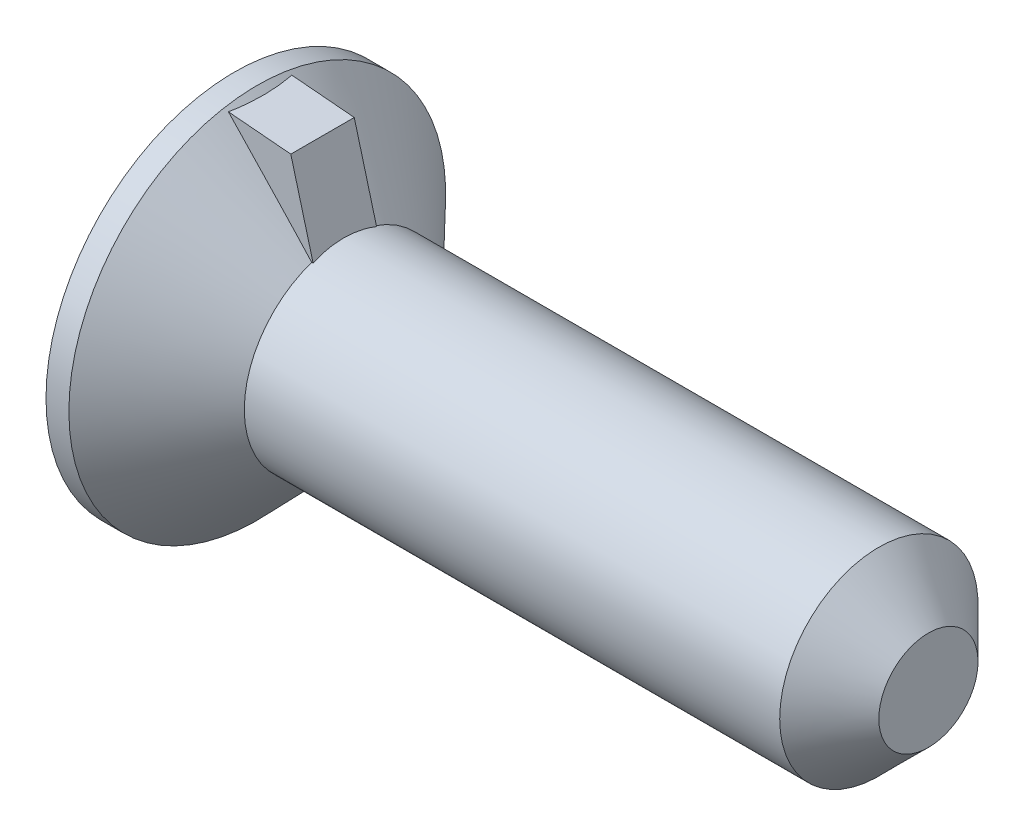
ISO-10303-21;
HEADER;
FILE_DESCRIPTION(('STEP AP214'),'2;1');
FILE_NAME('part.step','',(''),(''),'','','');
FILE_SCHEMA(('AUTOMOTIVE_DESIGN { 1 0 10303 214 1 1 1 1 }'));
ENDSEC;
DATA;
#1=APPLICATION_CONTEXT('core data for automotive mechanical design processes');
#2=APPLICATION_PROTOCOL_DEFINITION('international standard','automotive_design',2000,#1);
#3=PRODUCT_CONTEXT('',#1,'mechanical');
#4=PRODUCT('Part','Part','',(#3));
#5=PRODUCT_RELATED_PRODUCT_CATEGORY('part','',(#4));
#6=PRODUCT_DEFINITION_FORMATION('','',#4);
#7=PRODUCT_DEFINITION_CONTEXT('part definition',#1,'design');
#8=PRODUCT_DEFINITION('design','',#6,#7);
#9=PRODUCT_DEFINITION_SHAPE('','',#8);
#10=(LENGTH_UNIT() NAMED_UNIT(*) SI_UNIT(.MILLI.,.METRE.));
#11=(NAMED_UNIT(*) PLANE_ANGLE_UNIT() SI_UNIT($,.RADIAN.));
#12=(NAMED_UNIT(*) SI_UNIT($,.STERADIAN.) SOLID_ANGLE_UNIT());
#13=UNCERTAINTY_MEASURE_WITH_UNIT(LENGTH_MEASURE(1.E-05),#10,'distance_accuracy_value','');
#14=(GEOMETRIC_REPRESENTATION_CONTEXT(3) GLOBAL_UNCERTAINTY_ASSIGNED_CONTEXT((#13)) GLOBAL_UNIT_ASSIGNED_CONTEXT((#10,
#11,#12)) REPRESENTATION_CONTEXT('',''));
#15=CARTESIAN_POINT('',(0.,0.,0.));
#16=DIRECTION('',(0.,0.,1.));
#17=DIRECTION('',(1.,0.,0.));
#18=AXIS2_PLACEMENT_3D('',#15,#16,#17);
#19=CARTESIAN_POINT('',(5.5,0.,0.));
#20=DIRECTION('',(-1.,0.,0.));
#21=DIRECTION('',(0.,0.,1.));
#22=AXIS2_PLACEMENT_3D('',#19,#20,#21);
#23=CONICAL_SURFACE('',#22,5.,0.802851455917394);
#24=CARTESIAN_POINT('',(1.15440051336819,0.,0.));
#25=DIRECTION('',(-1.,0.,0.));
#26=DIRECTION('',(0.,0.,1.));
#27=AXIS2_PLACEMENT_3D('',#24,#25,#26);
#28=CIRCLE('',#27,9.5);
#29=CARTESIAN_POINT('',(1.15440051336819,0.,9.5));
#30=VERTEX_POINT('',#29);
#31=EDGE_CURVE('E153',#30,#30,#28,.T.);
#32=ORIENTED_EDGE('',*,*,#31,.F.);
#33=EDGE_LOOP('',(#32));
#34=FACE_BOUND('',#33,.T.);
#35=CARTESIAN_POINT('',(-4.56953233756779,15.3441118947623,1.6));
#36=CARTESIAN_POINT('',(-4.17278702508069,14.9310349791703,1.6));
#37=CARTESIAN_POINT('',(-3.7761241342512,14.5178788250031,1.6));
#38=CARTESIAN_POINT('',(-2.98296877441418,13.6912790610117,1.6));
#39=CARTESIAN_POINT('',(-2.58647634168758,13.2778354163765,1.6));
#40=CARTESIAN_POINT('',(-1.79239974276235,12.4492084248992,1.6));
#41=CARTESIAN_POINT('',(-1.3948166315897,12.0340240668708,1.6));
#42=CARTESIAN_POINT('',(-0.600121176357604,11.2033278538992,1.6));
#43=CARTESIAN_POINT('',(-0.203008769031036,10.7878160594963,1.6));
#44=CARTESIAN_POINT('',(0.512657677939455,10.0379553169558,1.6));
#45=CARTESIAN_POINT('',(0.831313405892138,9.70370343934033,1.6));
#46=CARTESIAN_POINT('',(1.4681290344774,9.03471580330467,1.6));
#47=CARTESIAN_POINT('',(1.78628892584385,8.69998003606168,1.6));
#48=CARTESIAN_POINT('',(2.42209227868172,8.02965256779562,1.6));
#49=CARTESIAN_POINT('',(2.73973533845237,7.69406048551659,1.6));
#50=CARTESIAN_POINT('',(3.37397747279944,7.02193567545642,1.6));
#51=CARTESIAN_POINT('',(3.69057661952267,6.685403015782,1.6));
#52=CARTESIAN_POINT('',(4.3210970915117,6.01207681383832,1.6));
#53=CARTESIAN_POINT('',(4.63502393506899,5.67528845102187,1.6));
#54=CARTESIAN_POINT('',(5.10401880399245,5.168264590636,1.6));
#55=CARTESIAN_POINT('',(5.26005604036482,4.99892613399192,1.6));
#56=CARTESIAN_POINT('',(5.57125243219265,4.65944943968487,1.6));
#57=CARTESIAN_POINT('',(5.72641160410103,4.48931121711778,1.6));
#58=CARTESIAN_POINT('',(6.03535238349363,4.14814548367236,1.6));
#59=CARTESIAN_POINT('',(6.18913537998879,3.9771192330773,1.6));
#60=CARTESIAN_POINT('',(6.49500182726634,3.63352769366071,1.6));
#61=CARTESIAN_POINT('',(6.64708514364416,3.46096228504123,1.6));
#62=CARTESIAN_POINT('',(6.94863767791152,3.11369207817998,1.6));
#63=CARTESIAN_POINT('',(7.09810811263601,2.93898834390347,1.6));
#64=CARTESIAN_POINT('',(7.31922346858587,2.67436787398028,1.6));
#65=CARTESIAN_POINT('',(7.39240883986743,2.58573946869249,1.6));
#66=CARTESIAN_POINT('',(7.53742548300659,2.40738322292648,1.6));
#67=CARTESIAN_POINT('',(7.6092568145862,2.31765543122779,1.6));
#68=CARTESIAN_POINT('',(7.70677524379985,2.19331281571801,1.6));
#69=CARTESIAN_POINT('',(7.73323970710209,2.15930709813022,1.6));
#70=CARTESIAN_POINT('',(7.78588139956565,2.09107306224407,1.6));
#71=CARTESIAN_POINT('',(7.81205862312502,2.05684473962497,1.6));
#72=CARTESIAN_POINT('',(7.89010973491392,1.95378845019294,1.6));
#73=CARTESIAN_POINT('',(7.94150037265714,1.88459258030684,1.6));
#74=CARTESIAN_POINT('',(8.04278620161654,1.74476618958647,1.6));
#75=CARTESIAN_POINT('',(8.09267596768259,1.67413172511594,1.6));
#76=CARTESIAN_POINT('',(8.19025409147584,1.53135643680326,1.6));
#77=CARTESIAN_POINT('',(8.23794260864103,1.45921572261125,1.6));
#78=CARTESIAN_POINT('',(8.32869500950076,1.31569416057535,1.6));
#79=CARTESIAN_POINT('',(8.37186374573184,1.24438009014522,1.6));
#80=CARTESIAN_POINT('',(8.45450024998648,1.09956993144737,1.6));
#81=CARTESIAN_POINT('',(8.49396631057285,1.02607285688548,1.6));
#82=CARTESIAN_POINT('',(8.56757929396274,0.876916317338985,1.6));
#83=CARTESIAN_POINT('',(8.60175353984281,0.801270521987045,1.6));
#84=CARTESIAN_POINT('',(8.66309523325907,0.647201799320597,1.6));
#85=CARTESIAN_POINT('',(8.69027086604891,0.568782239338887,1.6));
#86=CARTESIAN_POINT('',(8.72637659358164,0.440871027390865,1.6));
#87=CARTESIAN_POINT('',(8.73827087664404,0.392216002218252,1.6));
#88=CARTESIAN_POINT('',(8.7581413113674,0.294087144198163,1.6));
#89=CARTESIAN_POINT('',(8.76611665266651,0.244613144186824,1.6));
#90=CARTESIAN_POINT('',(8.77769923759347,0.145405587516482,1.6));
#91=CARTESIAN_POINT('',(8.78132859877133,0.0956746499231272,1.6));
#92=CARTESIAN_POINT('',(8.78408525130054,-0.00392871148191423,1.6));
#93=CARTESIAN_POINT('',(8.78321123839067,-0.0538011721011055,1.6));
#94=CARTESIAN_POINT('',(8.77701541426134,-0.153172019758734,1.6));
#95=CARTESIAN_POINT('',(8.77170179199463,-0.202670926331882,1.6));
#96=CARTESIAN_POINT('',(8.75693057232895,-0.301048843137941,1.6));
#97=CARTESIAN_POINT('',(8.74747197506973,-0.349927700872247,1.6));
#98=CARTESIAN_POINT('',(8.7248014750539,-0.447099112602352,1.6));
#99=CARTESIAN_POINT('',(8.71156781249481,-0.495386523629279,1.6));
#100=CARTESIAN_POINT('',(8.68190104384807,-0.590954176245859,1.6));
#101=CARTESIAN_POINT('',(8.66546800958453,-0.638234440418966,1.6));
#102=CARTESIAN_POINT('',(8.62381369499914,-0.747835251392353,1.6));
#103=CARTESIAN_POINT('',(8.59751260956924,-0.809743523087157,1.6));
#104=CARTESIAN_POINT('',(8.5411514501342,-0.93183765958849,1.6));
#105=CARTESIAN_POINT('',(8.51108931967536,-0.992022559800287,1.6));
#106=CARTESIAN_POINT('',(8.4480126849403,-1.11096032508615,1.6));
#107=CARTESIAN_POINT('',(8.41499264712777,-1.16971023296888,1.6));
#108=CARTESIAN_POINT('',(8.34669040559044,-1.2858853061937,1.6));
#109=CARTESIAN_POINT('',(8.31140774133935,-1.34331019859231,1.6));
#110=CARTESIAN_POINT('',(8.20209461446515,-1.51522592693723,1.6));
#111=CARTESIAN_POINT('',(8.12535324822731,-1.627991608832,1.6));
#112=CARTESIAN_POINT('',(8.00691764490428,-1.7946164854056,1.6));
#113=CARTESIAN_POINT('',(7.96691016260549,-1.84970523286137,1.6));
#114=CARTESIAN_POINT('',(7.88595982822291,-1.95919223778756,1.6));
#115=CARTESIAN_POINT('',(7.84501699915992,-2.01359051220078,1.6));
#116=CARTESIAN_POINT('',(7.73248085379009,-2.16094308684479,1.6));
#117=CARTESIAN_POINT('',(7.6601388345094,-2.25332436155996,1.6));
#118=CARTESIAN_POINT('',(7.51379855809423,-2.43676875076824,1.6));
#119=CARTESIAN_POINT('',(7.43980019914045,-2.52783178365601,1.6));
#120=CARTESIAN_POINT('',(7.215931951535,-2.79953305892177,1.6));
#121=CARTESIAN_POINT('',(7.06421636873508,-2.97864822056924,1.6));
#122=CARTESIAN_POINT('',(6.75762705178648,-3.33456061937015,1.6));
#123=CARTESIAN_POINT('',(6.60274928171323,-3.51135435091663,1.6));
#124=CARTESIAN_POINT('',(6.29106229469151,-3.86319136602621,1.6));
#125=CARTESIAN_POINT('',(6.13425330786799,-4.03823485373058,1.6));
#126=CARTESIAN_POINT('',(5.83188519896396,-4.37316485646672,1.6));
#127=CARTESIAN_POINT('',(5.68642886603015,-4.53314439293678,1.6));
#128=CARTESIAN_POINT('',(5.39467331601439,-4.85234322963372,1.6));
#129=CARTESIAN_POINT('',(5.24837406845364,-5.01156250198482,1.6));
#130=CARTESIAN_POINT('',(4.95549303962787,-5.32904012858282,1.6));
#131=CARTESIAN_POINT('',(4.80891275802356,-5.48729986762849,1.6));
#132=CARTESIAN_POINT('',(4.51526389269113,-5.80335167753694,1.6));
#133=CARTESIAN_POINT('',(4.36819533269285,-5.96114377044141,1.6));
#134=CARTESIAN_POINT('',(4.22094557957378,-6.11876584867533,1.6));
#135=B_SPLINE_CURVE_WITH_KNOTS('',3,(#35,#36,#37,#38,#39,#40,#41,#42,#43,#44,#45,#46,#47,#48,
#49,#50,#51,#52,#53,#54,#55,#56,#57,#58,#59,#60,#61,#62,#63,#64,#65,#66,#67,#68,#69,#70,#71,#72,
#73,#74,#75,#76,#77,#78,#79,#80,#81,#82,#83,#84,#85,#86,#87,#88,#89,#90,#91,#92,#93,#94,#95,#96,
#97,#98,#99,#100,#101,#102,#103,#104,#105,#106,#107,#108,#109,#110,#111,#112,#113,#114,#115,
#116,#117,#118,#119,#120,#121,#122,#123,#124,#125,#126,#127,#128,#129,#130,#131,#132,#133,#134),
.UNSPECIFIED.,.F.,.F.,(4,2,2,2,2,2,2,2,2,2,2,2,2,2,2,2,2,2,2,2,2,2,2,2,2,2,2,2,2,2,2,2,2,2,2,2,
2,2,2,2,2,2,2,2,2,2,2,2,2,4),(0.,1.71824173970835,3.43675177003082,5.16129598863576,
6.88557364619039,8.27099454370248,9.65644102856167,11.042683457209,12.4288279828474,
13.8100453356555,14.5008456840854,15.1916330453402,15.881619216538,16.5716595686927,
17.2613695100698,17.6061792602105,17.9509737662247,18.0802427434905,18.2095142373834,
18.468070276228,18.7274697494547,18.9868504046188,19.2368561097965,19.4869765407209,
19.7357590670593,19.9842492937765,20.134377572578,20.2845368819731,20.4339287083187,
20.5833638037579,20.7325238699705,20.8817199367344,21.0317939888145,21.1818646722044,
21.3834838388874,21.5852137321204,21.7873292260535,21.9894859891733,22.3984718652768,
22.6027200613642,22.8069632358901,23.1589428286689,23.5109441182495,24.2150807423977,
24.9201804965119,25.6251970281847,26.2738529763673,26.9225325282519,27.5696691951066,
28.2167748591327),.UNSPECIFIED.);
#136=CARTESIAN_POINT('',(1.2986429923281,9.21272646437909,1.6));
#137=VERTEX_POINT('',#136);
#138=CARTESIAN_POINT('',(5.5,4.7370877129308,1.6));
#139=VERTEX_POINT('',#138);
#140=EDGE_CURVE('E64',#137,#139,#135,.T.);
#141=ORIENTED_EDGE('',*,*,#140,.F.);
#142=CARTESIAN_POINT('',(1.29860694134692,9.21272961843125,-1.6002));
#143=CARTESIAN_POINT('',(1.3191671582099,9.2109308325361,-1.48616312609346));
#144=CARTESIAN_POINT('',(1.33766452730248,9.20931252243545,-1.37175889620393));
#145=CARTESIAN_POINT('',(1.37037147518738,9.20645103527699,-1.14232377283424));
#146=CARTESIAN_POINT('',(1.38458062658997,9.20520789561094,-1.02729281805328));
#147=CARTESIAN_POINT('',(1.42053121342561,9.20206262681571,-0.681415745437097));
#148=CARTESIAN_POINT('',(1.43558845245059,9.20074528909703,-0.449825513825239));
#149=CARTESIAN_POINT('',(1.44709809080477,9.19973832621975,0.0106292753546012));
#150=CARTESIAN_POINT('',(1.44380159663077,9.20002673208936,0.239487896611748));
#151=CARTESIAN_POINT('',(1.41934063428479,9.20216678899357,0.696130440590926));
#152=CARTESIAN_POINT('',(1.39818664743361,9.20401752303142,0.92391491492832));
#153=CARTESIAN_POINT('',(1.35875394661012,9.20746743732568,1.22565194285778));
#154=CARTESIAN_POINT('',(1.3480044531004,9.20840789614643,1.3006591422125));
#155=CARTESIAN_POINT('',(1.32466942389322,9.21044944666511,1.45056267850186));
#156=CARTESIAN_POINT('',(1.31207970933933,9.2115509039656,1.5254583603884));
#157=CARTESIAN_POINT('',(1.29860694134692,9.21272961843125,1.6002));
#158=B_SPLINE_CURVE_WITH_KNOTS('',3,(#142,#143,#144,#145,#146,#147,#148,#149,#150,#151,#152,
#153,#154,#155,#156,#157),.UNSPECIFIED.,.F.,.F.,(4,2,2,2,2,2,2,4),(0.,0.347631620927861,
0.695297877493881,1.39075235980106,2.07671557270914,2.76227644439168,2.98959957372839,
3.21744717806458),.UNSPECIFIED.);
#159=CARTESIAN_POINT('',(1.2986429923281,9.21272646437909,-1.6));
#160=VERTEX_POINT('',#159);
#161=EDGE_CURVE('E11',#160,#137,#158,.T.);
#162=ORIENTED_EDGE('',*,*,#161,.F.);
#163=CARTESIAN_POINT('',(-4.56953233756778,15.3441118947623,-1.6));
#164=CARTESIAN_POINT('',(-4.17278702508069,14.9310349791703,-1.6));
#165=CARTESIAN_POINT('',(-3.7761241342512,14.5178788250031,-1.6));
#166=CARTESIAN_POINT('',(-2.98296877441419,13.6912790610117,-1.6));
#167=CARTESIAN_POINT('',(-2.58647634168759,13.2778354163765,-1.6));
#168=CARTESIAN_POINT('',(-1.79239974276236,12.4492084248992,-1.6));
#169=CARTESIAN_POINT('',(-1.39481663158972,12.0340240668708,-1.6));
#170=CARTESIAN_POINT('',(-0.60012117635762,11.2033278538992,-1.6));
#171=CARTESIAN_POINT('',(-0.203008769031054,10.7878160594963,-1.6));
#172=CARTESIAN_POINT('',(0.512657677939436,10.0379553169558,-1.6));
#173=CARTESIAN_POINT('',(0.83131340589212,9.70370343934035,-1.6));
#174=CARTESIAN_POINT('',(1.46812903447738,9.03471580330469,-1.6));
#175=CARTESIAN_POINT('',(1.78628892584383,8.69998003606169,-1.6));
#176=CARTESIAN_POINT('',(2.4220922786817,8.02965256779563,-1.6));
#177=CARTESIAN_POINT('',(2.73973533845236,7.69406048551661,-1.6));
#178=CARTESIAN_POINT('',(3.37397747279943,7.02193567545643,-1.6));
#179=CARTESIAN_POINT('',(3.69057661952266,6.68540301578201,-1.6));
#180=CARTESIAN_POINT('',(4.32109709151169,6.01207681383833,-1.6));
#181=CARTESIAN_POINT('',(4.63502393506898,5.67528845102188,-1.6));
#182=CARTESIAN_POINT('',(5.10401880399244,5.168264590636,-1.6));
#183=CARTESIAN_POINT('',(5.26005604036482,4.99892613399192,-1.6));
#184=CARTESIAN_POINT('',(5.57125243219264,4.65944943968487,-1.6));
#185=CARTESIAN_POINT('',(5.72641160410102,4.48931121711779,-1.6));
#186=CARTESIAN_POINT('',(6.03535238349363,4.14814548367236,-1.6));
#187=CARTESIAN_POINT('',(6.18913537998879,3.97711923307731,-1.6));
#188=CARTESIAN_POINT('',(6.49500182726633,3.63352769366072,-1.6));
#189=CARTESIAN_POINT('',(6.64708514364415,3.46096228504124,-1.6));
#190=CARTESIAN_POINT('',(6.94863767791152,3.11369207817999,-1.6));
#191=CARTESIAN_POINT('',(7.09810811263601,2.93898834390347,-1.6));
#192=CARTESIAN_POINT('',(7.31922346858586,2.67436787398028,-1.6));
#193=CARTESIAN_POINT('',(7.39240883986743,2.58573946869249,-1.6));
#194=CARTESIAN_POINT('',(7.53742548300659,2.40738322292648,-1.6));
#195=CARTESIAN_POINT('',(7.6092568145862,2.31765543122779,-1.6));
#196=CARTESIAN_POINT('',(7.70677524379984,2.19331281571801,-1.6));
#197=CARTESIAN_POINT('',(7.73323970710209,2.15930709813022,-1.6));
#198=CARTESIAN_POINT('',(7.78588139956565,2.09107306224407,-1.6));
#199=CARTESIAN_POINT('',(7.81205862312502,2.05684473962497,-1.6));
#200=CARTESIAN_POINT('',(7.89010973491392,1.95378845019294,-1.6));
#201=CARTESIAN_POINT('',(7.94150037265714,1.88459258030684,-1.6));
#202=CARTESIAN_POINT('',(8.04278620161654,1.74476618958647,-1.6));
#203=CARTESIAN_POINT('',(8.09267596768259,1.67413172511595,-1.6));
#204=CARTESIAN_POINT('',(8.19025409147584,1.53135643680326,-1.6));
#205=CARTESIAN_POINT('',(8.23794260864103,1.45921572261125,-1.6));
#206=CARTESIAN_POINT('',(8.32869500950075,1.31569416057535,-1.6));
#207=CARTESIAN_POINT('',(8.37186374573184,1.24438009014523,-1.6));
#208=CARTESIAN_POINT('',(8.45450024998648,1.09956993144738,-1.6));
#209=CARTESIAN_POINT('',(8.49396631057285,1.02607285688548,-1.6));
#210=CARTESIAN_POINT('',(8.56757929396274,0.876916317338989,-1.6));
#211=CARTESIAN_POINT('',(8.60175353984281,0.801270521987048,-1.6));
#212=CARTESIAN_POINT('',(8.66309523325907,0.647201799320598,-1.6));
#213=CARTESIAN_POINT('',(8.69027086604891,0.568782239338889,-1.6));
#214=CARTESIAN_POINT('',(8.72637659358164,0.440871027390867,-1.6));
#215=CARTESIAN_POINT('',(8.73827087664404,0.392216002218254,-1.6));
#216=CARTESIAN_POINT('',(8.7581413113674,0.294087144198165,-1.6));
#217=CARTESIAN_POINT('',(8.76611665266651,0.244613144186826,-1.6));
#218=CARTESIAN_POINT('',(8.77769923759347,0.145405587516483,-1.6));
#219=CARTESIAN_POINT('',(8.78132859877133,0.0956746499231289,-1.6));
#220=CARTESIAN_POINT('',(8.78408525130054,-0.00392871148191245,-1.6));
#221=CARTESIAN_POINT('',(8.78321123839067,-0.0538011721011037,-1.6));
#222=CARTESIAN_POINT('',(8.77701541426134,-0.153172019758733,-1.6));
#223=CARTESIAN_POINT('',(8.77170179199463,-0.202670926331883,-1.6));
#224=CARTESIAN_POINT('',(8.75693057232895,-0.301048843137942,-1.6));
#225=CARTESIAN_POINT('',(8.74747197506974,-0.349927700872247,-1.6));
#226=CARTESIAN_POINT('',(8.7248014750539,-0.447099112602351,-1.6));
#227=CARTESIAN_POINT('',(8.71156781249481,-0.495386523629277,-1.6));
#228=CARTESIAN_POINT('',(8.68190104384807,-0.590954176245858,-1.6));
#229=CARTESIAN_POINT('',(8.66546800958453,-0.638234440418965,-1.6));
#230=CARTESIAN_POINT('',(8.62381369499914,-0.747835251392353,-1.6));
#231=CARTESIAN_POINT('',(8.59751260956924,-0.809743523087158,-1.6));
#232=CARTESIAN_POINT('',(8.54115145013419,-0.931837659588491,-1.6));
#233=CARTESIAN_POINT('',(8.51108931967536,-0.992022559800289,-1.6));
#234=CARTESIAN_POINT('',(8.4480126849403,-1.11096032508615,-1.6));
#235=CARTESIAN_POINT('',(8.41499264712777,-1.16971023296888,-1.6));
#236=CARTESIAN_POINT('',(8.34669040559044,-1.2858853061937,-1.6));
#237=CARTESIAN_POINT('',(8.31140774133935,-1.34331019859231,-1.6));
#238=CARTESIAN_POINT('',(8.20209461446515,-1.51522592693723,-1.6));
#239=CARTESIAN_POINT('',(8.12535324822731,-1.627991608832,-1.6));
#240=CARTESIAN_POINT('',(8.00691764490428,-1.7946164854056,-1.6));
#241=CARTESIAN_POINT('',(7.96691016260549,-1.84970523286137,-1.6));
#242=CARTESIAN_POINT('',(7.88595982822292,-1.95919223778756,-1.6));
#243=CARTESIAN_POINT('',(7.84501699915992,-2.01359051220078,-1.6));
#244=CARTESIAN_POINT('',(7.73248085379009,-2.16094308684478,-1.6));
#245=CARTESIAN_POINT('',(7.6601388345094,-2.25332436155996,-1.6));
#246=CARTESIAN_POINT('',(7.51379855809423,-2.43676875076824,-1.6));
#247=CARTESIAN_POINT('',(7.43980019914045,-2.52783178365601,-1.6));
#248=CARTESIAN_POINT('',(7.215931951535,-2.79953305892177,-1.6));
#249=CARTESIAN_POINT('',(7.06421636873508,-2.97864822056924,-1.6));
#250=CARTESIAN_POINT('',(6.75762705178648,-3.33456061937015,-1.6));
#251=CARTESIAN_POINT('',(6.60274928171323,-3.51135435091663,-1.6));
#252=CARTESIAN_POINT('',(6.29106229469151,-3.86319136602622,-1.6));
#253=CARTESIAN_POINT('',(6.13425330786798,-4.03823485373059,-1.6));
#254=CARTESIAN_POINT('',(5.83188519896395,-4.37316485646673,-1.6));
#255=CARTESIAN_POINT('',(5.68642886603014,-4.53314439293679,-1.6));
#256=CARTESIAN_POINT('',(5.39467331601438,-4.85234322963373,-1.6));
#257=CARTESIAN_POINT('',(5.24837406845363,-5.01156250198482,-1.6));
#258=CARTESIAN_POINT('',(4.95549303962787,-5.32904012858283,-1.6));
#259=CARTESIAN_POINT('',(4.80891275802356,-5.48729986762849,-1.6));
#260=CARTESIAN_POINT('',(4.51526389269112,-5.80335167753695,-1.6));
#261=CARTESIAN_POINT('',(4.36819533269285,-5.96114377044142,-1.6));
#262=CARTESIAN_POINT('',(4.22094557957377,-6.11876584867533,-1.6));
#263=B_SPLINE_CURVE_WITH_KNOTS('',3,(#163,#164,#165,#166,#167,#168,#169,#170,#171,#172,#173,
#174,#175,#176,#177,#178,#179,#180,#181,#182,#183,#184,#185,#186,#187,#188,#189,#190,#191,#192,
#193,#194,#195,#196,#197,#198,#199,#200,#201,#202,#203,#204,#205,#206,#207,#208,#209,#210,#211,
#212,#213,#214,#215,#216,#217,#218,#219,#220,#221,#222,#223,#224,#225,#226,#227,#228,#229,#230,
#231,#232,#233,#234,#235,#236,#237,#238,#239,#240,#241,#242,#243,#244,#245,#246,#247,#248,#249,
#250,#251,#252,#253,#254,#255,#256,#257,#258,#259,#260,#261,#262),.UNSPECIFIED.,.F.,.F.,(4,2,2,
2,2,2,2,2,2,2,2,2,2,2,2,2,2,2,2,2,2,2,2,2,2,2,2,2,2,2,2,2,2,2,2,2,2,2,2,2,2,2,2,2,2,2,2,2,2,4),
(0.,1.71824173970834,3.4367517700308,5.16129598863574,6.88557364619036,8.27099454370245,
9.65644102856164,11.042683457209,12.4288279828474,13.8100453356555,14.5008456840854,
15.1916330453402,15.881619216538,16.5716595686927,17.2613695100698,17.6061792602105,
17.9509737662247,18.0802427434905,18.2095142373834,18.468070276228,18.7274697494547,
18.9868504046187,19.2368561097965,19.4869765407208,19.7357590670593,19.9842492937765,
20.1343775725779,20.2845368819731,20.4339287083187,20.5833638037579,20.7325238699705,
20.8817199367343,21.0317939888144,21.1818646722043,21.3834838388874,21.5852137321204,
21.7873292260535,21.9894859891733,22.3984718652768,22.6027200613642,22.8069632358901,
23.1589428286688,23.5109441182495,24.2150807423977,24.9201804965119,25.6251970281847,
26.2738529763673,26.9225325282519,27.5696691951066,28.2167748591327),.UNSPECIFIED.);
#264=CARTESIAN_POINT('',(5.5,4.7370877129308,-1.6));
#265=VERTEX_POINT('',#264);
#266=EDGE_CURVE('E93',#160,#265,#263,.T.);
#267=ORIENTED_EDGE('',*,*,#266,.T.);
#268=CARTESIAN_POINT('',(5.5,0.,0.));
#269=DIRECTION('',(-1.,0.,0.));
#270=DIRECTION('',(0.,0.,1.));
#271=AXIS2_PLACEMENT_3D('',#268,#269,#270);
#272=CIRCLE('',#271,5.);
#273=EDGE_CURVE('E150',#265,#139,#272,.T.);
#274=ORIENTED_EDGE('',*,*,#273,.T.);
#275=EDGE_LOOP('',(#141,#162,#267,#274));
#276=FACE_BOUND('',#275,.T.);
#277=ADVANCED_FACE('F35',(#34,#276),#23,.T.);
#278=CARTESIAN_POINT('',(0.,0.,0.));
#279=DIRECTION('',(-1.,0.,0.));
#280=DIRECTION('',(0.,0.,1.));
#281=AXIS2_PLACEMENT_3D('',#278,#279,#280);
#282=CYLINDRICAL_SURFACE('',#281,5.);
#283=CARTESIAN_POINT('',(32.5,0.,0.));
#284=DIRECTION('',(-1.,0.,0.));
#285=DIRECTION('',(0.,0.,1.));
#286=AXIS2_PLACEMENT_3D('',#283,#284,#285);
#287=CIRCLE('',#286,5.);
#288=CARTESIAN_POINT('',(32.5,0.,5.));
#289=VERTEX_POINT('',#288);
#290=EDGE_CURVE('E146',#289,#289,#287,.T.);
#291=ORIENTED_EDGE('',*,*,#290,.T.);
#292=EDGE_LOOP('',(#291));
#293=FACE_BOUND('',#292,.T.);
#294=DIRECTION('',(-1.,0.,0.));
#295=VECTOR('',#294,1.);
#296=CARTESIAN_POINT('',(0.,4.7370877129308,1.6));
#297=LINE('',#296,#295);
#298=CARTESIAN_POINT('',(5.57044713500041,4.7370877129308,1.6));
#299=VERTEX_POINT('',#298);
#300=EDGE_CURVE('E49',#139,#299,#297,.F.);
#301=ORIENTED_EDGE('',*,*,#300,.F.);
#302=ORIENTED_EDGE('',*,*,#273,.F.);
#303=DIRECTION('',(-1.,0.,0.));
#304=VECTOR('',#303,1.);
#305=CARTESIAN_POINT('',(0.,4.7370877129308,-1.6));
#306=LINE('',#305,#304);
#307=CARTESIAN_POINT('',(5.57044713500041,4.7370877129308,-1.6));
#308=VERTEX_POINT('',#307);
#309=EDGE_CURVE('E163',#265,#308,#306,.F.);
#310=ORIENTED_EDGE('',*,*,#309,.T.);
#311=CARTESIAN_POINT('',(6.83974596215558,0.,0.));
#312=DIRECTION('',(-0.96592582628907,-0.258819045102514,0.));
#313=DIRECTION('',(-0.258819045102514,0.96592582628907,0.));
#314=AXIS2_PLACEMENT_3D('',#311,#312,#313);
#315=ELLIPSE('',#314,5.17638090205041,5.);
#316=EDGE_CURVE('E151',#299,#308,#315,.T.);
#317=ORIENTED_EDGE('',*,*,#316,.F.);
#318=EDGE_LOOP('',(#301,#302,#310,#317));
#319=FACE_BOUND('',#318,.T.);
#320=ADVANCED_FACE('F134',(#293,#319),#282,.T.);
#321=CARTESIAN_POINT('',(0.,0.,0.));
#322=DIRECTION('',(1.,0.,0.));
#323=DIRECTION('',(0.,0.,-1.));
#324=AXIS2_PLACEMENT_3D('',#321,#322,#323);
#325=PLANE('',#324);
#326=CARTESIAN_POINT('',(0.,0.,0.));
#327=DIRECTION('',(-1.,0.,0.));
#328=DIRECTION('',(0.,0.,1.));
#329=AXIS2_PLACEMENT_3D('',#326,#327,#328);
#330=CIRCLE('',#329,9.5);
#331=CARTESIAN_POINT('',(0.,0.,9.5));
#332=VERTEX_POINT('',#331);
#333=EDGE_CURVE('E156',#332,#332,#330,.T.);
#334=ORIENTED_EDGE('',*,*,#333,.T.);
#335=EDGE_LOOP('',(#334));
#336=FACE_BOUND('',#335,.T.);
#337=ADVANCED_FACE('F37',(#336),#325,.F.);
#338=CARTESIAN_POINT('',(0.,0.,0.));
#339=DIRECTION('',(-1.,0.,0.));
#340=DIRECTION('',(0.,0.,1.));
#341=AXIS2_PLACEMENT_3D('',#338,#339,#340);
#342=CYLINDRICAL_SURFACE('',#341,9.5);
#343=ORIENTED_EDGE('',*,*,#333,.F.);
#344=EDGE_LOOP('',(#343));
#345=FACE_BOUND('',#344,.T.);
#346=ORIENTED_EDGE('',*,*,#31,.T.);
#347=EDGE_LOOP('',(#346));
#348=FACE_BOUND('',#347,.T.);
#349=ADVANCED_FACE('F132',(#345,#348),#342,.T.);
#350=CARTESIAN_POINT('',(35.,0.,0.));
#351=DIRECTION('',(-1.,0.,0.));
#352=DIRECTION('',(0.,0.,1.));
#353=AXIS2_PLACEMENT_3D('',#350,#351,#352);
#354=CONICAL_SURFACE('',#353,2.50000000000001,0.785398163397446);
#355=ORIENTED_EDGE('',*,*,#290,.F.);
#356=EDGE_LOOP('',(#355));
#357=FACE_BOUND('',#356,.T.);
#358=CARTESIAN_POINT('',(35.,0.,0.));
#359=DIRECTION('',(-1.,0.,0.));
#360=DIRECTION('',(0.,0.,1.));
#361=AXIS2_PLACEMENT_3D('',#358,#359,#360);
#362=CIRCLE('',#361,2.50000000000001);
#363=CARTESIAN_POINT('',(35.,0.,2.50000000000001));
#364=VERTEX_POINT('',#363);
#365=EDGE_CURVE('E158',#364,#364,#362,.T.);
#366=ORIENTED_EDGE('',*,*,#365,.T.);
#367=EDGE_LOOP('',(#366));
#368=FACE_BOUND('',#367,.T.);
#369=ADVANCED_FACE('F129',(#357,#368),#354,.T.);
#370=CARTESIAN_POINT('',(35.,2.50000000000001,0.));
#371=DIRECTION('',(-1.,0.,0.));
#372=DIRECTION('',(0.,0.,1.));
#373=AXIS2_PLACEMENT_3D('',#370,#371,#372);
#374=PLANE('',#373);
#375=ORIENTED_EDGE('',*,*,#365,.F.);
#376=EDGE_LOOP('',(#375));
#377=FACE_BOUND('',#376,.T.);
#378=ADVANCED_FACE('F126',(#377),#374,.F.);
#379=CARTESIAN_POINT('',(1.15440051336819,9.22534604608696,1.6));
#380=DIRECTION('',(-0.0871557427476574,-0.996194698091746,0.));
#381=DIRECTION('',(0.996194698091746,-0.0871557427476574,0.));
#382=AXIS2_PLACEMENT_3D('',#379,#380,#381);
#383=PLANE('',#382);
#384=DIRECTION('',(-0.996194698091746,0.0871557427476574,0.));
#385=VECTOR('',#384,1.);
#386=CARTESIAN_POINT('',(1.15440051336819,9.22534604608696,-1.6));
#387=LINE('',#386,#385);
#388=CARTESIAN_POINT('',(4.44496095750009,8.93745931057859,-1.6));
#389=VERTEX_POINT('',#388);
#390=EDGE_CURVE('E98',#389,#160,#387,.T.);
#391=ORIENTED_EDGE('',*,*,#390,.T.);
#392=ORIENTED_EDGE('',*,*,#161,.T.);
#393=DIRECTION('',(-0.996194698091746,0.0871557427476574,0.));
#394=VECTOR('',#393,1.);
#395=CARTESIAN_POINT('',(1.15440051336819,9.22534604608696,1.6));
#396=LINE('',#395,#394);
#397=CARTESIAN_POINT('',(4.44496095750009,8.93745931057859,1.6));
#398=VERTEX_POINT('',#397);
#399=EDGE_CURVE('E85',#398,#137,#396,.T.);
#400=ORIENTED_EDGE('',*,*,#399,.F.);
#401=DIRECTION('',(0.,0.,-1.));
#402=VECTOR('',#401,1.);
#403=CARTESIAN_POINT('',(4.44496095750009,8.93745931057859,1.6));
#404=LINE('',#403,#402);
#405=EDGE_CURVE('E87',#398,#389,#404,.T.);
#406=ORIENTED_EDGE('',*,*,#405,.T.);
#407=EDGE_LOOP('',(#391,#392,#400,#406));
#408=FACE_BOUND('',#407,.T.);
#409=ADVANCED_FACE('F95',(#408),#383,.F.);
#410=CARTESIAN_POINT('',(4.44496095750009,8.93745931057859,1.6));
#411=DIRECTION('',(-0.96592582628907,-0.258819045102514,0.));
#412=DIRECTION('',(0.258819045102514,-0.96592582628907,0.));
#413=AXIS2_PLACEMENT_3D('',#410,#411,#412);
#414=PLANE('',#413);
#415=DIRECTION('',(-0.258819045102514,0.96592582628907,0.));
#416=VECTOR('',#415,1.);
#417=CARTESIAN_POINT('',(4.44496095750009,8.93745931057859,1.6));
#418=LINE('',#417,#416);
#419=EDGE_CURVE('E81',#299,#398,#418,.T.);
#420=ORIENTED_EDGE('',*,*,#419,.F.);
#421=ORIENTED_EDGE('',*,*,#316,.T.);
#422=DIRECTION('',(-0.258819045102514,0.96592582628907,0.));
#423=VECTOR('',#422,1.);
#424=CARTESIAN_POINT('',(4.44496095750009,8.93745931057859,-1.6));
#425=LINE('',#424,#423);
#426=EDGE_CURVE('E56',#308,#389,#425,.T.);
#427=ORIENTED_EDGE('',*,*,#426,.T.);
#428=ORIENTED_EDGE('',*,*,#405,.F.);
#429=EDGE_LOOP('',(#420,#421,#427,#428));
#430=FACE_BOUND('',#429,.T.);
#431=ADVANCED_FACE('F90',(#430),#414,.F.);
#432=CARTESIAN_POINT('',(1.15440051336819,9.22534604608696,1.6));
#433=DIRECTION('',(0.,0.,-1.));
#434=DIRECTION('',(-1.,0.,0.));
#435=AXIS2_PLACEMENT_3D('',#432,#433,#434);
#436=PLANE('',#435);
#437=ORIENTED_EDGE('',*,*,#399,.T.);
#438=ORIENTED_EDGE('',*,*,#140,.T.);
#439=ORIENTED_EDGE('',*,*,#300,.T.);
#440=ORIENTED_EDGE('',*,*,#419,.T.);
#441=EDGE_LOOP('',(#437,#438,#439,#440));
#442=FACE_BOUND('',#441,.T.);
#443=ADVANCED_FACE('F83',(#442),#436,.F.);
#444=CARTESIAN_POINT('',(1.15440051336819,9.22534604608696,-1.6));
#445=DIRECTION('',(0.,0.,-1.));
#446=DIRECTION('',(-1.,0.,0.));
#447=AXIS2_PLACEMENT_3D('',#444,#445,#446);
#448=PLANE('',#447);
#449=ORIENTED_EDGE('',*,*,#266,.F.);
#450=ORIENTED_EDGE('',*,*,#390,.F.);
#451=ORIENTED_EDGE('',*,*,#426,.F.);
#452=ORIENTED_EDGE('',*,*,#309,.F.);
#453=EDGE_LOOP('',(#449,#450,#451,#452));
#454=FACE_BOUND('',#453,.T.);
#455=ADVANCED_FACE('F117',(#454),#448,.T.);
#456=CLOSED_SHELL('',(#277,#320,#337,#349,#369,#378,#409,#431,#443,#455));
#457=MANIFOLD_SOLID_BREP('B2',#456);
#458=ADVANCED_BREP_SHAPE_REPRESENTATION('',(#18,#457),#14);
#459=SHAPE_DEFINITION_REPRESENTATION(#9,#458);
ENDSEC;
END-ISO-10303-21;
